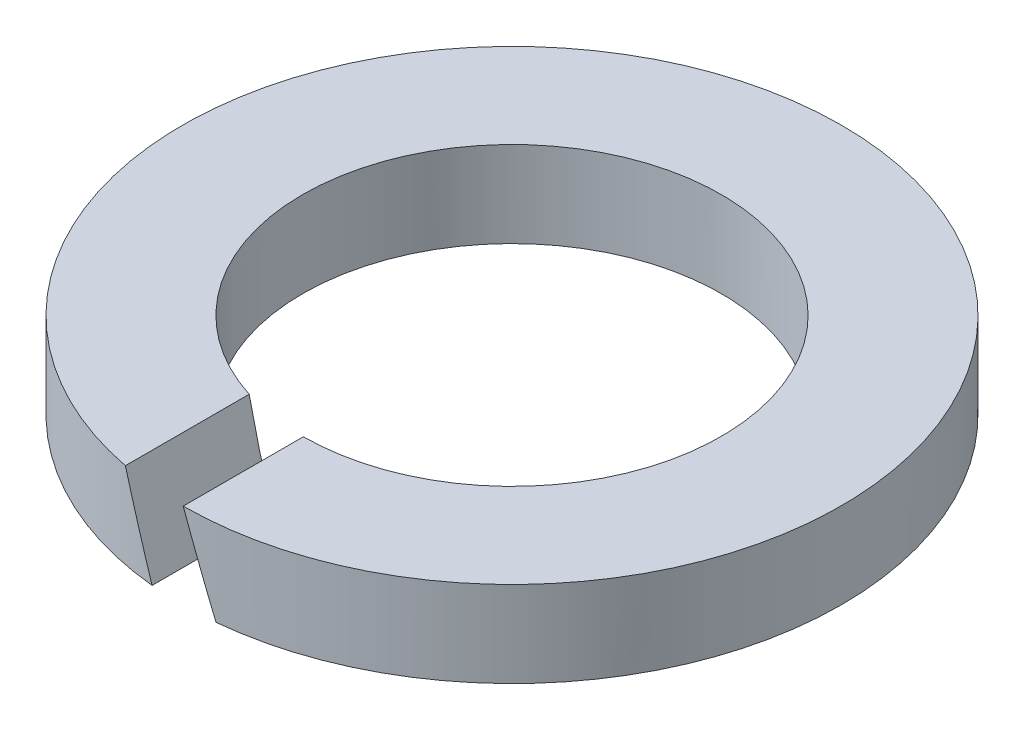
from build123d import *

# Parameters (mm, degrees)
SKE_W          = 3.5
SKE_H          = 2.5
CUT_REACH      = 15.805
CUT_END_RADIUS = 9.6


with BuildPart() as part:
    # Ske → Base (revolve)
    with BuildSketch(Plane.XY, mode=Mode.PRIVATE) as base_sk:
        with Locations((-7.85, 1.25)):
            Rectangle(SKE_W, SKE_H)
    revolve(base_sk.sketch.rotate(Axis((0, 15.759672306, 0), (0, -1, 0)), 270), axis=Axis((0, 15.759672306, 0), (0, -1, 0)))

    # Cut: up to this cylinder (the profile starts inside it)
    cut_end = Plane(origin=(0, 1.25, 0), z_dir=(0, 1, 0)) * Cylinder(CUT_END_RADIUS, 51.81, mode=Mode.PRIVATE)
    # Ske4 → Cut (cut, up to the surface)
    with BuildSketch(Plane.XY, mode=Mode.PRIVATE) as cut_sk1:
        Polygon((-0.931155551, 0), (0.931155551, 0), (0.021229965, 2.5), (-1.841081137, 2.5), align=None)
    cut_tool1 = extrude(cut_sk1.sketch, amount=CUT_REACH, mode=Mode.PRIVATE) & cut_end
    add(cut_tool1.solids().sort_by_distance((-0.454963, 1.25, 0))[0], mode=Mode.SUBTRACT)


solid = part.part
